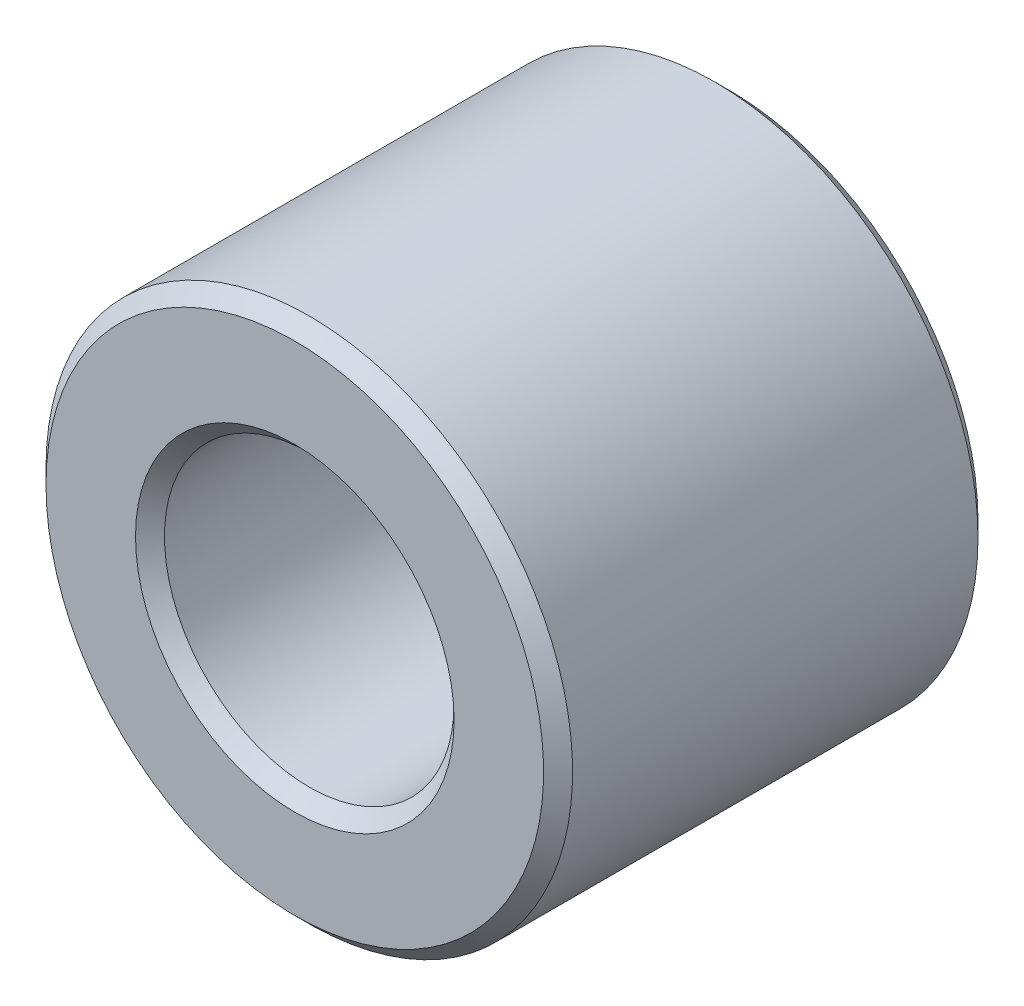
ISO-10303-21;
HEADER;
FILE_DESCRIPTION(('STEP AP214'),'2;1');
FILE_NAME('part.step','',(''),(''),'','','');
FILE_SCHEMA(('AUTOMOTIVE_DESIGN { 1 0 10303 214 1 1 1 1 }'));
ENDSEC;
DATA;
#1=APPLICATION_CONTEXT('core data for automotive mechanical design processes');
#2=APPLICATION_PROTOCOL_DEFINITION('international standard','automotive_design',2000,#1);
#3=PRODUCT_CONTEXT('',#1,'mechanical');
#4=PRODUCT('Part','Part','',(#3));
#5=PRODUCT_RELATED_PRODUCT_CATEGORY('part','',(#4));
#6=PRODUCT_DEFINITION_FORMATION('','',#4);
#7=PRODUCT_DEFINITION_CONTEXT('part definition',#1,'design');
#8=PRODUCT_DEFINITION('design','',#6,#7);
#9=PRODUCT_DEFINITION_SHAPE('','',#8);
#10=(LENGTH_UNIT() NAMED_UNIT(*) SI_UNIT(.MILLI.,.METRE.));
#11=(NAMED_UNIT(*) PLANE_ANGLE_UNIT() SI_UNIT($,.RADIAN.));
#12=(NAMED_UNIT(*) SI_UNIT($,.STERADIAN.) SOLID_ANGLE_UNIT());
#13=UNCERTAINTY_MEASURE_WITH_UNIT(LENGTH_MEASURE(1.E-05),#10,'distance_accuracy_value','');
#14=(GEOMETRIC_REPRESENTATION_CONTEXT(3) GLOBAL_UNCERTAINTY_ASSIGNED_CONTEXT((#13)) GLOBAL_UNIT_ASSIGNED_CONTEXT((#10,
#11,#12)) REPRESENTATION_CONTEXT('',''));
#15=CARTESIAN_POINT('',(0.,0.,0.));
#16=DIRECTION('',(0.,0.,1.));
#17=DIRECTION('',(1.,0.,0.));
#18=AXIS2_PLACEMENT_3D('',#15,#16,#17);
#19=CARTESIAN_POINT('',(0.,0.,33.));
#20=DIRECTION('',(0.,0.,1.));
#21=DIRECTION('',(1.,0.,0.));
#22=AXIS2_PLACEMENT_3D('',#19,#20,#21);
#23=PLANE('',#22);
#24=CARTESIAN_POINT('',(0.,0.,33.));
#25=DIRECTION('',(0.,0.,1.));
#26=DIRECTION('',(1.,0.,0.));
#27=AXIS2_PLACEMENT_3D('',#24,#25,#26);
#28=CIRCLE('',#27,24.2);
#29=CARTESIAN_POINT('',(24.2,0.,33.));
#30=VERTEX_POINT('',#29);
#31=EDGE_CURVE('E10',#30,#30,#28,.F.);
#32=ORIENTED_EDGE('',*,*,#31,.T.);
#33=EDGE_LOOP('',(#32));
#34=FACE_BOUND('',#33,.T.);
#35=CARTESIAN_POINT('',(0.,0.,33.));
#36=DIRECTION('',(0.,0.,1.));
#37=DIRECTION('',(1.,0.,0.));
#38=AXIS2_PLACEMENT_3D('',#35,#36,#37);
#39=CIRCLE('',#38,37.8);
#40=CARTESIAN_POINT('',(-37.8,0.,33.));
#41=VERTEX_POINT('',#40);
#42=EDGE_CURVE('E45',#41,#41,#39,.T.);
#43=ORIENTED_EDGE('',*,*,#42,.T.);
#44=EDGE_LOOP('',(#43));
#45=FACE_BOUND('',#44,.T.);
#46=ADVANCED_FACE('F37',(#34,#45),#23,.T.);
#47=CARTESIAN_POINT('',(0.,0.,-33.));
#48=DIRECTION('',(0.,0.,1.));
#49=DIRECTION('',(1.,0.,0.));
#50=AXIS2_PLACEMENT_3D('',#47,#48,#49);
#51=PLANE('',#50);
#52=CARTESIAN_POINT('',(0.,0.,-33.));
#53=DIRECTION('',(0.,0.,1.));
#54=DIRECTION('',(1.,0.,0.));
#55=AXIS2_PLACEMENT_3D('',#52,#53,#54);
#56=CIRCLE('',#55,24.2);
#57=CARTESIAN_POINT('',(24.2,0.,-33.));
#58=VERTEX_POINT('',#57);
#59=EDGE_CURVE('E70',#58,#58,#56,.T.);
#60=ORIENTED_EDGE('',*,*,#59,.T.);
#61=EDGE_LOOP('',(#60));
#62=FACE_BOUND('',#61,.T.);
#63=CARTESIAN_POINT('',(0.,0.,-33.));
#64=DIRECTION('',(0.,0.,1.));
#65=DIRECTION('',(1.,0.,0.));
#66=AXIS2_PLACEMENT_3D('',#63,#64,#65);
#67=CIRCLE('',#66,37.8);
#68=CARTESIAN_POINT('',(37.8,0.,-33.));
#69=VERTEX_POINT('',#68);
#70=EDGE_CURVE('E74',#69,#69,#67,.F.);
#71=ORIENTED_EDGE('',*,*,#70,.T.);
#72=EDGE_LOOP('',(#71));
#73=FACE_BOUND('',#72,.T.);
#74=ADVANCED_FACE('F78',(#62,#73),#51,.F.);
#75=CARTESIAN_POINT('',(0.,0.,33.));
#76=DIRECTION('',(0.,0.,-1.));
#77=DIRECTION('',(-1.,0.,0.));
#78=AXIS2_PLACEMENT_3D('',#75,#76,#77);
#79=CYLINDRICAL_SURFACE('',#78,40.);
#80=CARTESIAN_POINT('',(0.,0.,-30.8));
#81=DIRECTION('',(0.,0.,1.));
#82=DIRECTION('',(1.,0.,0.));
#83=AXIS2_PLACEMENT_3D('',#80,#81,#82);
#84=CIRCLE('',#83,40.);
#85=CARTESIAN_POINT('',(-40.,0.,-30.8));
#86=VERTEX_POINT('',#85);
#87=EDGE_CURVE('E51',#86,#86,#84,.T.);
#88=CARTESIAN_POINT('',(0.,0.,30.8));
#89=DIRECTION('',(0.,0.,1.));
#90=DIRECTION('',(1.,0.,0.));
#91=AXIS2_PLACEMENT_3D('',#88,#89,#90);
#92=CIRCLE('',#91,40.);
#93=CARTESIAN_POINT('',(-40.,0.,30.8));
#94=VERTEX_POINT('',#93);
#95=EDGE_CURVE('E57',#94,#94,#92,.F.);
#96=CARTESIAN_POINT('',(-40.,0.,-30.8));
#97=CARTESIAN_POINT('',(-40.,0.,-30.1583333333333));
#98=CARTESIAN_POINT('',(-40.,0.,-29.5166666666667));
#99=CARTESIAN_POINT('',(-40.,0.,-28.2333333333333));
#100=CARTESIAN_POINT('',(-40.,0.,-27.5916666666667));
#101=CARTESIAN_POINT('',(-40.,0.,-26.3083333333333));
#102=CARTESIAN_POINT('',(-40.,0.,-25.6666666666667));
#103=CARTESIAN_POINT('',(-40.,0.,-24.3833333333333));
#104=CARTESIAN_POINT('',(-40.,0.,-23.7416666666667));
#105=CARTESIAN_POINT('',(-40.,0.,-22.4583333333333));
#106=CARTESIAN_POINT('',(-40.,0.,-21.8166666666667));
#107=CARTESIAN_POINT('',(-40.,0.,-20.5333333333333));
#108=CARTESIAN_POINT('',(-40.,0.,-19.8916666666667));
#109=CARTESIAN_POINT('',(-40.,0.,-18.6083333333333));
#110=CARTESIAN_POINT('',(-40.,0.,-17.9666666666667));
#111=CARTESIAN_POINT('',(-40.,0.,-16.6833333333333));
#112=CARTESIAN_POINT('',(-40.,0.,-16.0416666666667));
#113=CARTESIAN_POINT('',(-40.,0.,-14.7583333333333));
#114=CARTESIAN_POINT('',(-40.,0.,-14.1166666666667));
#115=CARTESIAN_POINT('',(-40.,0.,-12.8333333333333));
#116=CARTESIAN_POINT('',(-40.,0.,-12.1916666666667));
#117=CARTESIAN_POINT('',(-40.,0.,-10.9083333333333));
#118=CARTESIAN_POINT('',(-40.,0.,-10.2666666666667));
#119=CARTESIAN_POINT('',(-40.,0.,-8.98333333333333));
#120=CARTESIAN_POINT('',(-40.,0.,-8.34166666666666));
#121=CARTESIAN_POINT('',(-40.,0.,-7.05833333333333));
#122=CARTESIAN_POINT('',(-40.,0.,-6.41666666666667));
#123=CARTESIAN_POINT('',(-40.,0.,-5.13333333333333));
#124=CARTESIAN_POINT('',(-40.,0.,-4.49166666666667));
#125=CARTESIAN_POINT('',(-40.,0.,-3.20833333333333));
#126=CARTESIAN_POINT('',(-40.,0.,-2.56666666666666));
#127=CARTESIAN_POINT('',(-40.,0.,-1.28333333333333));
#128=CARTESIAN_POINT('',(-40.,0.,-0.641666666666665));
#129=CARTESIAN_POINT('',(-40.,0.,0.641666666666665));
#130=CARTESIAN_POINT('',(-40.,0.,1.28333333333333));
#131=CARTESIAN_POINT('',(-40.,0.,2.56666666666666));
#132=CARTESIAN_POINT('',(-40.,0.,3.20833333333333));
#133=CARTESIAN_POINT('',(-40.,0.,4.49166666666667));
#134=CARTESIAN_POINT('',(-40.,0.,5.13333333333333));
#135=CARTESIAN_POINT('',(-40.,0.,6.41666666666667));
#136=CARTESIAN_POINT('',(-40.,0.,7.05833333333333));
#137=CARTESIAN_POINT('',(-40.,0.,8.34166666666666));
#138=CARTESIAN_POINT('',(-40.,0.,8.98333333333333));
#139=CARTESIAN_POINT('',(-40.,0.,10.2666666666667));
#140=CARTESIAN_POINT('',(-40.,0.,10.9083333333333));
#141=CARTESIAN_POINT('',(-40.,0.,12.1916666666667));
#142=CARTESIAN_POINT('',(-40.,0.,12.8333333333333));
#143=CARTESIAN_POINT('',(-40.,0.,14.1166666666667));
#144=CARTESIAN_POINT('',(-40.,0.,14.7583333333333));
#145=CARTESIAN_POINT('',(-40.,0.,16.0416666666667));
#146=CARTESIAN_POINT('',(-40.,0.,16.6833333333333));
#147=CARTESIAN_POINT('',(-40.,0.,17.9666666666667));
#148=CARTESIAN_POINT('',(-40.,0.,18.6083333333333));
#149=CARTESIAN_POINT('',(-40.,0.,19.8916666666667));
#150=CARTESIAN_POINT('',(-40.,0.,20.5333333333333));
#151=CARTESIAN_POINT('',(-40.,0.,21.8166666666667));
#152=CARTESIAN_POINT('',(-40.,0.,22.4583333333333));
#153=CARTESIAN_POINT('',(-40.,0.,23.7416666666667));
#154=CARTESIAN_POINT('',(-40.,0.,24.3833333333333));
#155=CARTESIAN_POINT('',(-40.,0.,25.6666666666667));
#156=CARTESIAN_POINT('',(-40.,0.,26.3083333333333));
#157=CARTESIAN_POINT('',(-40.,0.,27.5916666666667));
#158=CARTESIAN_POINT('',(-40.,0.,28.2333333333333));
#159=CARTESIAN_POINT('',(-40.,0.,29.5166666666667));
#160=CARTESIAN_POINT('',(-40.,0.,30.1583333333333));
#161=CARTESIAN_POINT('',(-40.,0.,30.8));
#162=B_SPLINE_CURVE_WITH_KNOTS('',3,(#96,#97,#98,#99,#100,#101,#102,#103,#104,#105,#106,#107,
#108,#109,#110,#111,#112,#113,#114,#115,#116,#117,#118,#119,#120,#121,#122,#123,#124,#125,#126,
#127,#128,#129,#130,#131,#132,#133,#134,#135,#136,#137,#138,#139,#140,#141,#142,#143,#144,#145,
#146,#147,#148,#149,#150,#151,#152,#153,#154,#155,#156,#157,#158,#159,#160,#161),.UNSPECIFIED.,
.F.,.F.,(4,2,2,2,2,2,2,2,2,2,2,2,2,2,2,2,2,2,2,2,2,2,2,2,2,2,2,2,2,2,2,2,4),(0.,1.925,3.85,
5.775,7.7,9.62499999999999,11.55,13.475,15.4,17.325,19.25,21.175,23.1,25.025,26.95,28.875,30.8,
32.725,34.65,36.575,38.5,40.425,42.35,44.275,46.2,48.125,50.05,51.975,53.9,55.825,57.75,59.675,
61.6),.UNSPECIFIED.);
#163=EDGE_CURVE('BSEAM88',#86,#94,#162,.T.);
#164=ORIENTED_EDGE('',*,*,#87,.T.);
#165=ORIENTED_EDGE('',*,*,#95,.T.);
#166=ORIENTED_EDGE('',*,*,#163,.T.);
#167=ORIENTED_EDGE('',*,*,#163,.F.);
#168=EDGE_LOOP('',(#164,#166,#165,#167));
#169=FACE_BOUND('',#168,.T.);
#170=ADVANCED_FACE('F88',(#169),#79,.T.);
#171=CARTESIAN_POINT('',(0.,0.,33.));
#172=DIRECTION('',(0.,0.,-1.));
#173=DIRECTION('',(-1.,0.,0.));
#174=AXIS2_PLACEMENT_3D('',#171,#172,#173);
#175=CYLINDRICAL_SURFACE('',#174,22.);
#176=CARTESIAN_POINT('',(0.,0.,-30.8));
#177=DIRECTION('',(0.,0.,1.));
#178=DIRECTION('',(1.,0.,0.));
#179=AXIS2_PLACEMENT_3D('',#176,#177,#178);
#180=CIRCLE('',#179,22.);
#181=CARTESIAN_POINT('',(22.,0.,-30.8));
#182=VERTEX_POINT('',#181);
#183=EDGE_CURVE('E63',#182,#182,#180,.F.);
#184=ORIENTED_EDGE('',*,*,#183,.T.);
#185=EDGE_LOOP('',(#184));
#186=FACE_BOUND('',#185,.T.);
#187=CARTESIAN_POINT('',(0.,0.,30.8));
#188=DIRECTION('',(0.,0.,1.));
#189=DIRECTION('',(1.,0.,0.));
#190=AXIS2_PLACEMENT_3D('',#187,#188,#189);
#191=CIRCLE('',#190,22.);
#192=CARTESIAN_POINT('',(22.,0.,30.8));
#193=VERTEX_POINT('',#192);
#194=EDGE_CURVE('E66',#193,#193,#191,.T.);
#195=ORIENTED_EDGE('',*,*,#194,.T.);
#196=EDGE_LOOP('',(#195));
#197=FACE_BOUND('',#196,.T.);
#198=ADVANCED_FACE('F91',(#186,#197),#175,.F.);
#199=CARTESIAN_POINT('',(0.,0.,-33.));
#200=DIRECTION('',(0.,0.,-1.));
#201=DIRECTION('',(-1.,0.,0.));
#202=AXIS2_PLACEMENT_3D('',#199,#200,#201);
#203=CONICAL_SURFACE('',#202,24.2,0.785398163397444);
#204=ORIENTED_EDGE('',*,*,#183,.F.);
#205=EDGE_LOOP('',(#204));
#206=FACE_BOUND('',#205,.T.);
#207=ORIENTED_EDGE('',*,*,#59,.F.);
#208=EDGE_LOOP('',(#207));
#209=FACE_BOUND('',#208,.T.);
#210=ADVANCED_FACE('F84',(#206,#209),#203,.F.);
#211=CARTESIAN_POINT('',(0.,0.,-30.8));
#212=DIRECTION('',(0.,0.,1.));
#213=DIRECTION('',(1.,0.,0.));
#214=AXIS2_PLACEMENT_3D('',#211,#212,#213);
#215=CONICAL_SURFACE('',#214,40.,0.785398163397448);
#216=ORIENTED_EDGE('',*,*,#70,.F.);
#217=EDGE_LOOP('',(#216));
#218=FACE_BOUND('',#217,.T.);
#219=ORIENTED_EDGE('',*,*,#87,.F.);
#220=EDGE_LOOP('',(#219));
#221=FACE_BOUND('',#220,.T.);
#222=ADVANCED_FACE('F80',(#218,#221),#215,.T.);
#223=CARTESIAN_POINT('',(0.,0.,30.8));
#224=DIRECTION('',(0.,0.,1.));
#225=DIRECTION('',(1.,0.,0.));
#226=AXIS2_PLACEMENT_3D('',#223,#224,#225);
#227=CONICAL_SURFACE('',#226,22.,0.78539816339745);
#228=ORIENTED_EDGE('',*,*,#31,.F.);
#229=EDGE_LOOP('',(#228));
#230=FACE_BOUND('',#229,.T.);
#231=ORIENTED_EDGE('',*,*,#194,.F.);
#232=EDGE_LOOP('',(#231));
#233=FACE_BOUND('',#232,.T.);
#234=ADVANCED_FACE('F83',(#230,#233),#227,.F.);
#235=CARTESIAN_POINT('',(0.,0.,33.));
#236=DIRECTION('',(0.,0.,-1.));
#237=DIRECTION('',(-1.,0.,0.));
#238=AXIS2_PLACEMENT_3D('',#235,#236,#237);
#239=CONICAL_SURFACE('',#238,37.8,0.785398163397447);
#240=CARTESIAN_POINT('',(-40.,0.,30.8));
#241=CARTESIAN_POINT('',(-39.9770833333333,0.,30.8229166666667));
#242=CARTESIAN_POINT('',(-39.9541666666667,0.,30.8458333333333));
#243=CARTESIAN_POINT('',(-39.9083333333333,0.,30.8916666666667));
#244=CARTESIAN_POINT('',(-39.8854166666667,0.,30.9145833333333));
#245=CARTESIAN_POINT('',(-39.8395833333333,0.,30.9604166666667));
#246=CARTESIAN_POINT('',(-39.8166666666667,0.,30.9833333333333));
#247=CARTESIAN_POINT('',(-39.7708333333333,0.,31.0291666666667));
#248=CARTESIAN_POINT('',(-39.7479166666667,0.,31.0520833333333));
#249=CARTESIAN_POINT('',(-39.7020833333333,0.,31.0979166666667));
#250=CARTESIAN_POINT('',(-39.6791666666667,0.,31.1208333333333));
#251=CARTESIAN_POINT('',(-39.6333333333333,0.,31.1666666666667));
#252=CARTESIAN_POINT('',(-39.6104166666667,0.,31.1895833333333));
#253=CARTESIAN_POINT('',(-39.5645833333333,0.,31.2354166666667));
#254=CARTESIAN_POINT('',(-39.5416666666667,0.,31.2583333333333));
#255=CARTESIAN_POINT('',(-39.4958333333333,0.,31.3041666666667));
#256=CARTESIAN_POINT('',(-39.4729166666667,0.,31.3270833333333));
#257=CARTESIAN_POINT('',(-39.4270833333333,0.,31.3729166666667));
#258=CARTESIAN_POINT('',(-39.4041666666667,0.,31.3958333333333));
#259=CARTESIAN_POINT('',(-39.3583333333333,0.,31.4416666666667));
#260=CARTESIAN_POINT('',(-39.3354166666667,0.,31.4645833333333));
#261=CARTESIAN_POINT('',(-39.2895833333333,0.,31.5104166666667));
#262=CARTESIAN_POINT('',(-39.2666666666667,0.,31.5333333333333));
#263=CARTESIAN_POINT('',(-39.2208333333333,0.,31.5791666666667));
#264=CARTESIAN_POINT('',(-39.1979166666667,0.,31.6020833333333));
#265=CARTESIAN_POINT('',(-39.1520833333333,0.,31.6479166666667));
#266=CARTESIAN_POINT('',(-39.1291666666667,0.,31.6708333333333));
#267=CARTESIAN_POINT('',(-39.0833333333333,0.,31.7166666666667));
#268=CARTESIAN_POINT('',(-39.0604166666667,0.,31.7395833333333));
#269=CARTESIAN_POINT('',(-39.0145833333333,0.,31.7854166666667));
#270=CARTESIAN_POINT('',(-38.9916666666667,0.,31.8083333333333));
#271=CARTESIAN_POINT('',(-38.9458333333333,0.,31.8541666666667));
#272=CARTESIAN_POINT('',(-38.9229166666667,0.,31.8770833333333));
#273=CARTESIAN_POINT('',(-38.8770833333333,0.,31.9229166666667));
#274=CARTESIAN_POINT('',(-38.8541666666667,0.,31.9458333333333));
#275=CARTESIAN_POINT('',(-38.8083333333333,0.,31.9916666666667));
#276=CARTESIAN_POINT('',(-38.7854166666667,0.,32.0145833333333));
#277=CARTESIAN_POINT('',(-38.7395833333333,0.,32.0604166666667));
#278=CARTESIAN_POINT('',(-38.7166666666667,0.,32.0833333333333));
#279=CARTESIAN_POINT('',(-38.6708333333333,0.,32.1291666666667));
#280=CARTESIAN_POINT('',(-38.6479166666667,0.,32.1520833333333));
#281=CARTESIAN_POINT('',(-38.6020833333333,0.,32.1979166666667));
#282=CARTESIAN_POINT('',(-38.5791666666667,0.,32.2208333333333));
#283=CARTESIAN_POINT('',(-38.5333333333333,0.,32.2666666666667));
#284=CARTESIAN_POINT('',(-38.5104166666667,0.,32.2895833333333));
#285=CARTESIAN_POINT('',(-38.4645833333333,0.,32.3354166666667));
#286=CARTESIAN_POINT('',(-38.4416666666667,0.,32.3583333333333));
#287=CARTESIAN_POINT('',(-38.3958333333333,0.,32.4041666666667));
#288=CARTESIAN_POINT('',(-38.3729166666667,0.,32.4270833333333));
#289=CARTESIAN_POINT('',(-38.3270833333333,0.,32.4729166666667));
#290=CARTESIAN_POINT('',(-38.3041666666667,0.,32.4958333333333));
#291=CARTESIAN_POINT('',(-38.2583333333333,0.,32.5416666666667));
#292=CARTESIAN_POINT('',(-38.2354166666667,0.,32.5645833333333));
#293=CARTESIAN_POINT('',(-38.1895833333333,0.,32.6104166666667));
#294=CARTESIAN_POINT('',(-38.1666666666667,0.,32.6333333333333));
#295=CARTESIAN_POINT('',(-38.1208333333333,0.,32.6791666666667));
#296=CARTESIAN_POINT('',(-38.0979166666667,0.,32.7020833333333));
#297=CARTESIAN_POINT('',(-38.0520833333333,0.,32.7479166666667));
#298=CARTESIAN_POINT('',(-38.0291666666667,0.,32.7708333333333));
#299=CARTESIAN_POINT('',(-37.9833333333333,0.,32.8166666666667));
#300=CARTESIAN_POINT('',(-37.9604166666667,0.,32.8395833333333));
#301=CARTESIAN_POINT('',(-37.9145833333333,0.,32.8854166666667));
#302=CARTESIAN_POINT('',(-37.8916666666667,0.,32.9083333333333));
#303=CARTESIAN_POINT('',(-37.8458333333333,0.,32.9541666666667));
#304=CARTESIAN_POINT('',(-37.8229166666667,0.,32.9770833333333));
#305=CARTESIAN_POINT('',(-37.8,0.,33.));
#306=B_SPLINE_CURVE_WITH_KNOTS('',3,(#240,#241,#242,#243,#244,#245,#246,#247,#248,#249,#250,
#251,#252,#253,#254,#255,#256,#257,#258,#259,#260,#261,#262,#263,#264,#265,#266,#267,#268,#269,
#270,#271,#272,#273,#274,#275,#276,#277,#278,#279,#280,#281,#282,#283,#284,#285,#286,#287,#288,
#289,#290,#291,#292,#293,#294,#295,#296,#297,#298,#299,#300,#301,#302,#303,#304,#305),
.UNSPECIFIED.,.F.,.F.,(4,2,2,2,2,2,2,2,2,2,2,2,2,2,2,2,2,2,2,2,2,2,2,2,2,2,2,2,2,2,2,2,4),(0.,
0.0972271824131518,0.194454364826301,0.291681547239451,0.3889087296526,0.486135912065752,
0.583363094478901,0.680590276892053,0.777817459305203,0.875044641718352,0.972271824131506,
1.06949900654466,1.1667261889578,1.26395337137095,1.3611805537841,1.45840773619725,
1.55563491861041,1.65286210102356,1.75008928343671,1.84731646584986,1.944543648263,
2.04177083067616,2.13899801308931,2.23622519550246,2.33345237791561,2.43067956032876,
2.52790674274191,2.62513392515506,2.72236110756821,2.81958828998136,2.91681547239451,
3.01404265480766,3.11126983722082),.UNSPECIFIED.);
#307=EDGE_CURVE('BSEAM39',#94,#41,#306,.T.);
#308=ORIENTED_EDGE('',*,*,#95,.F.);
#309=ORIENTED_EDGE('',*,*,#42,.F.);
#310=ORIENTED_EDGE('',*,*,#307,.T.);
#311=ORIENTED_EDGE('',*,*,#307,.F.);
#312=EDGE_LOOP('',(#308,#310,#309,#311));
#313=FACE_BOUND('',#312,.T.);
#314=ADVANCED_FACE('F39',(#313),#239,.T.);
#315=CLOSED_SHELL('',(#46,#74,#170,#198,#210,#222,#234,#314));
#316=MANIFOLD_SOLID_BREP('B2',#315);
#317=ADVANCED_BREP_SHAPE_REPRESENTATION('',(#18,#316),#14);
#318=SHAPE_DEFINITION_REPRESENTATION(#9,#317);
ENDSEC;
END-ISO-10303-21;
